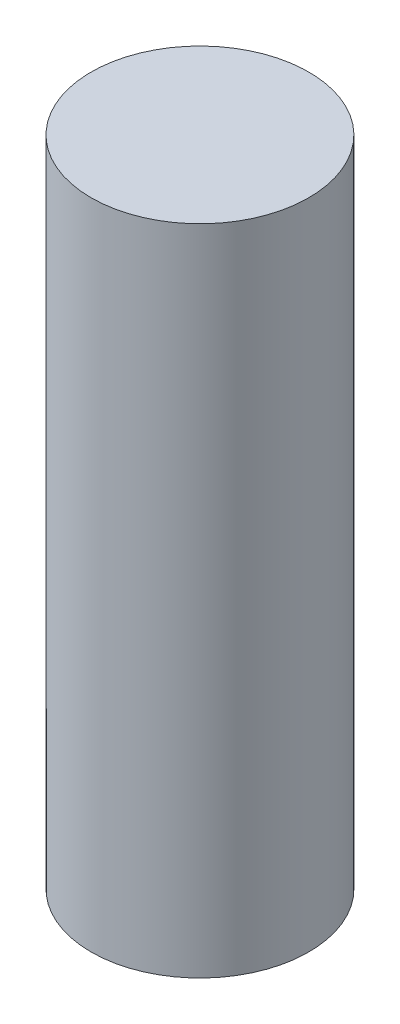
from build123d import *

# Parameters (mm, degrees)
SKETCH1_R           = 1
BOSS_EXTRUDE1_DEPTH = 6


with BuildPart() as part:
    # Sketch1 → Boss-Extrude1 (new body)
    with BuildSketch(Plane(origin=(0, 0, 0), x_dir=(1, 0, 0), z_dir=(0, 1, 0))):
        with Locations(Location((0, 0, 0), (0, 0, 270))):
            Circle(SKETCH1_R)
    extrude(amount=BOSS_EXTRUDE1_DEPTH)


solid = part.part
